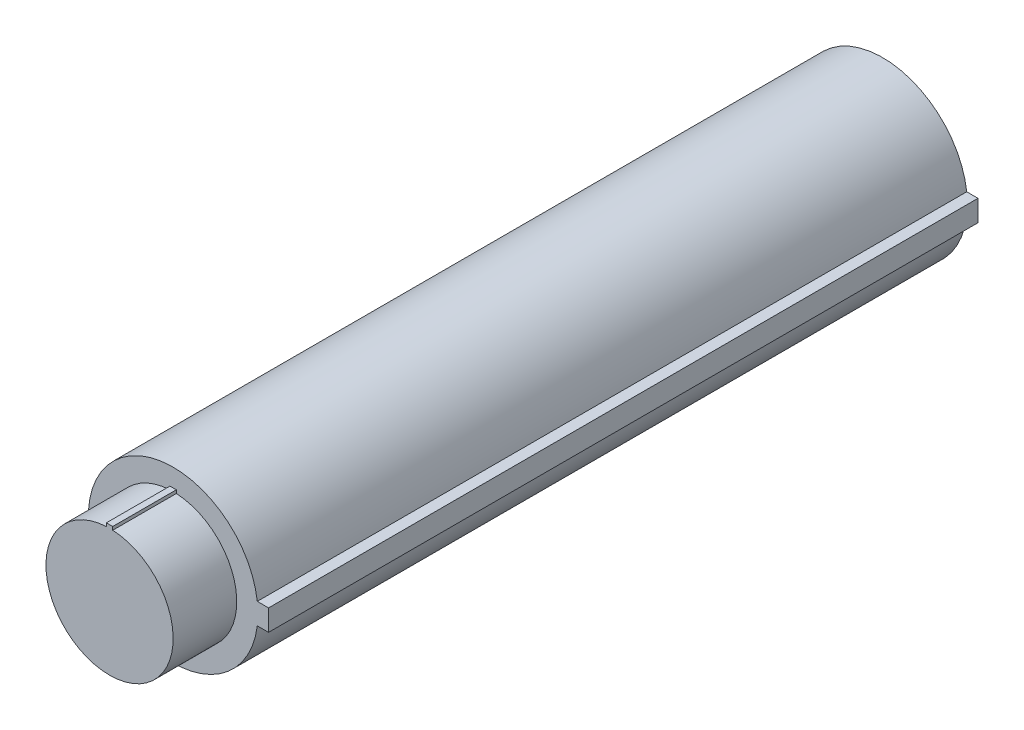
from build123d import *

# Parameters (mm, degrees)
CROQUIS2_W              = 1.5
CROQUIS2_H              = 1.5
SALIENTE_EXTRUIR1_DEPTH = 15
CROQUIS3_W              = 5
CROQUIS3_H              = 5
SALIENTE_EXTRUIR2_DEPTH = 167.32


with BuildPart() as part:
    # Croquis1 → Revoluci_n1 (revolve)
    with BuildSketch(Plane(origin=(0, 0, 0), x_dir=(0, 0, -1), z_dir=(1, 0, 0)), mode=Mode.PRIVATE) as revoluci_n1_sk:
        Polygon((0, 0), (0, 15), (15, 15), (15, 20), (182.32, 20), (182.32, 0), align=None)
    revolve(revoluci_n1_sk.sketch.rotate(Axis((0, 0, 0), (0, 0, -1)), 90), axis=Axis((0, 0, 0), (0, 0, -1)))

    # Croquis2 → Saliente-Extruir1 (add)
    with BuildSketch(Plane.XY):
        with Locations((0, 15)):
            Rectangle(CROQUIS2_W, CROQUIS2_H)
    extrude(amount=-SALIENTE_EXTRUIR1_DEPTH)

    # Croquis3 → Saliente-Extruir2 (add)
    with BuildSketch(Plane(origin=(0, 0, -182.32), x_dir=(-1, 0, 0), z_dir=(0, 0, -1))):
        with Locations((-20, 0)):
            Rectangle(CROQUIS3_W, CROQUIS3_H)
    extrude(amount=-SALIENTE_EXTRUIR2_DEPTH)


solid = part.part
